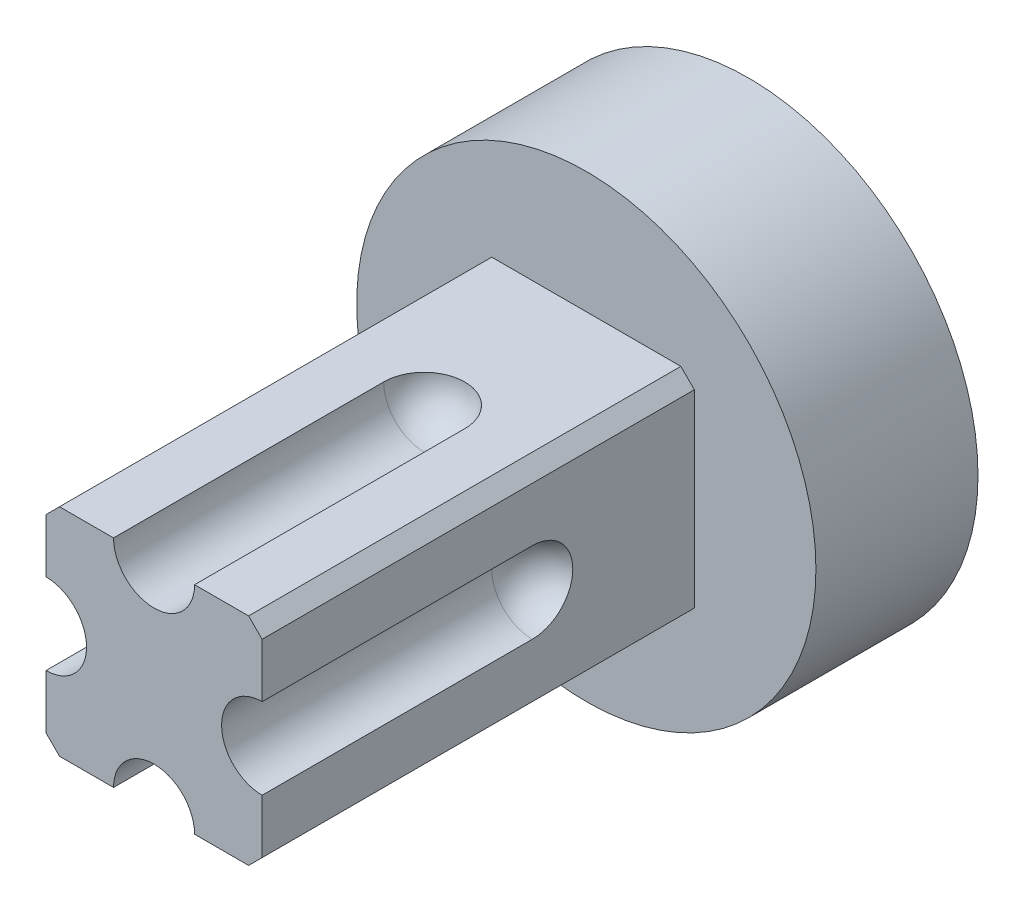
from build123d import *

# Parameters (mm, degrees)
SKETCH1_R                    = 13.49375
EXTRUDE1_DEPTH               = 9.525
SKETCH4_W                    = 12.7
SKETCH4_H                    = 12.7
STUB_DEPTH                   = 25.4
CIRPATTERN1_COUNT            = 4
CHAMFER2_SIZE                = 0.79375
F_5_16_18_TAPPED_HOLE1_D     = 6.5278
F_5_16_18_TAPPED_HOLE1_DEPTH = 15.875
F_5_16_18_TAPPED_HOLE1_TIP   = 1.961148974


with BuildPart() as part:
    # Sketch1 → Extrude1 (new body)
    with BuildSketch(Plane.XY):
        with Locations((-82.55, 82.55)):
            Circle(SKETCH1_R)
    extrude(amount=EXTRUDE1_DEPTH)

    # Sketch4 → stub (add)
    with BuildSketch(Plane.XY.offset(9.525)):
        with Locations((-82.55, 82.55)):
            Rectangle(SKETCH4_W, SKETCH4_H)
    extrude(amount=STUB_DEPTH)

    # Sketch30 → Cut-Revolve3 (revolve, cut)
    with BuildSketch(Plane(origin=(0, 82.55, 0), x_dir=(0, 0, -1), z_dir=(0, 1, 0))):
        with BuildLine():
            Line((-19.05, 86.51875), (-53.215350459, 86.51875))
            Line((-53.215350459, 86.51875), (-53.215350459, 88.9))
            Line((-53.215350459, 88.9), (-16.66875, 88.9))
            ThreePointArc((-16.66875, 88.9), (-17.366201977, 87.216201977), (-19.05, 86.51875))
        make_face()
    cut_revolve3 = revolve(axis=Axis((-88.9, 82.55, 53.215350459), (0, 0, 1)), mode=Mode.SUBTRACT)

    # CirPattern1: Cut-Revolve3 ×4 about axis
    cirpattern1_axis = Axis((-82.55, 82.55, 0), (0, 0, 1))
    for i in range(1, CIRPATTERN1_COUNT):
        add(cut_revolve3.rotate(cirpattern1_axis, i * 360 / CIRPATTERN1_COUNT), mode=Mode.SUBTRACT)

    # Chamfer2
    chamfer2_edges = [part.edges().sort_by_distance(p)[0] for p in [
        (-88.9, 88.9, 22.225),
        (-88.9, 76.2, 22.225),
        (-76.2, 76.2, 22.225),
        (-76.2, 88.9, 22.225),
    ]]
    chamfer(chamfer2_edges, length=CHAMFER2_SIZE)

    # 5_16-18 Tapped Hole1
    with Locations(Plane(origin=(0, 0, 0), x_dir=(-1, 0, 0), z_dir=(0, 0, -1))):
        with Locations((82.55, 82.55)):
            Hole(F_5_16_18_TAPPED_HOLE1_D / 2, depth=F_5_16_18_TAPPED_HOLE1_DEPTH)
            with Locations((0, 0, -(F_5_16_18_TAPPED_HOLE1_DEPTH + F_5_16_18_TAPPED_HOLE1_TIP / 2))):  # 118° drill point
                Cone(0, F_5_16_18_TAPPED_HOLE1_D / 2, F_5_16_18_TAPPED_HOLE1_TIP, mode=Mode.SUBTRACT)


solid = part.part
